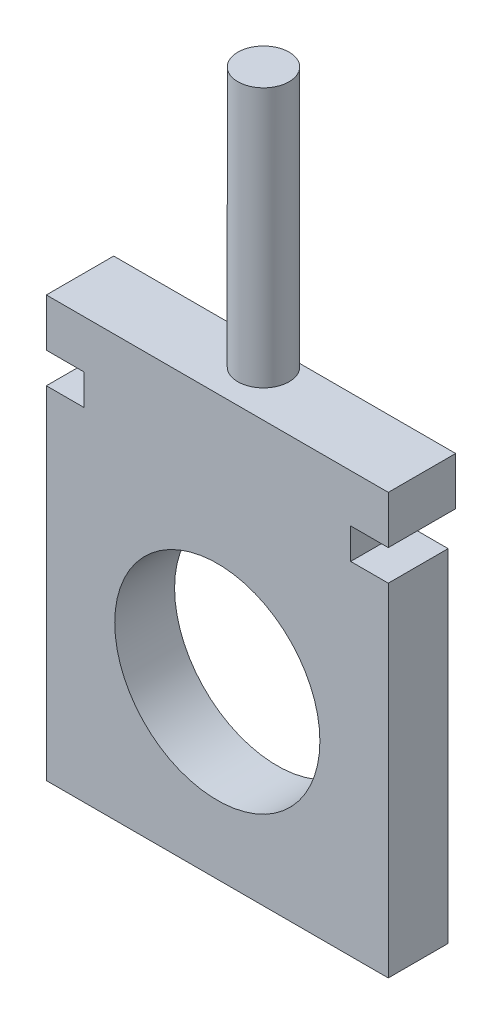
from build123d import *

# Parameters (mm, degrees)
SKETCH1_W           = 127
SKETCH1_H           = 127
BOSS_EXTRUDE1_DEPTH = 22.225
SKETCH2_R           = 38.1
CUT_EXTRUDE1_DEPTH  = 93.511894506
SKETCH3_W           = 99.06
SKETCH3_H           = 12.7
BOSS_EXTRUDE2_DEPTH = 11.43
SKETCH4_W           = 127
SKETCH4_H           = 25.019
BOSS_EXTRUDE3_DEPTH = 17.78
SKETCH5_R           = 9.525
BOSS_EXTRUDE4_DEPTH = 96.52


with BuildPart() as part:
    # Sketch1 → Boss-Extrude1 (new body)
    with BuildSketch(Plane.XY):
        Rectangle(SKETCH1_W, SKETCH1_H)
    extrude(amount=BOSS_EXTRUDE1_DEPTH)

    # Sketch2 → Cut-Extrude1 (cut, through all)
    with BuildSketch(Plane.XY.offset(22.225)):
        Circle(SKETCH2_R)
    extrude(amount=-CUT_EXTRUDE1_DEPTH, mode=Mode.SUBTRACT)

    # Sketch3 → Boss-Extrude2 (add)
    with BuildSketch(Plane(origin=(0, 63.5, 0), x_dir=(1, 0, 0), z_dir=(0, 1, 0))):
        with Locations((0, -15.875)):
            Rectangle(SKETCH3_W, SKETCH3_H)
    extrude(amount=BOSS_EXTRUDE2_DEPTH)

    # Sketch4 → Boss-Extrude3 (add)
    with BuildSketch(Plane(origin=(0, 74.93, 0), x_dir=(1, 0, 0), z_dir=(0, 1, 0))):
        with Locations((0, -9.7155)):
            Rectangle(SKETCH4_W, SKETCH4_H)
    extrude(amount=BOSS_EXTRUDE3_DEPTH)

    # Sketch5 → Boss-Extrude4 (add)
    with BuildSketch(Plane(origin=(0, 92.71, 0), x_dir=(1, 0, 0), z_dir=(0, 1, 0))):
        with Locations(Location((0, -5.08, 0), (0, 0, 124.242168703))):
            Circle(SKETCH5_R)
    extrude(amount=BOSS_EXTRUDE4_DEPTH)


solid = part.part
